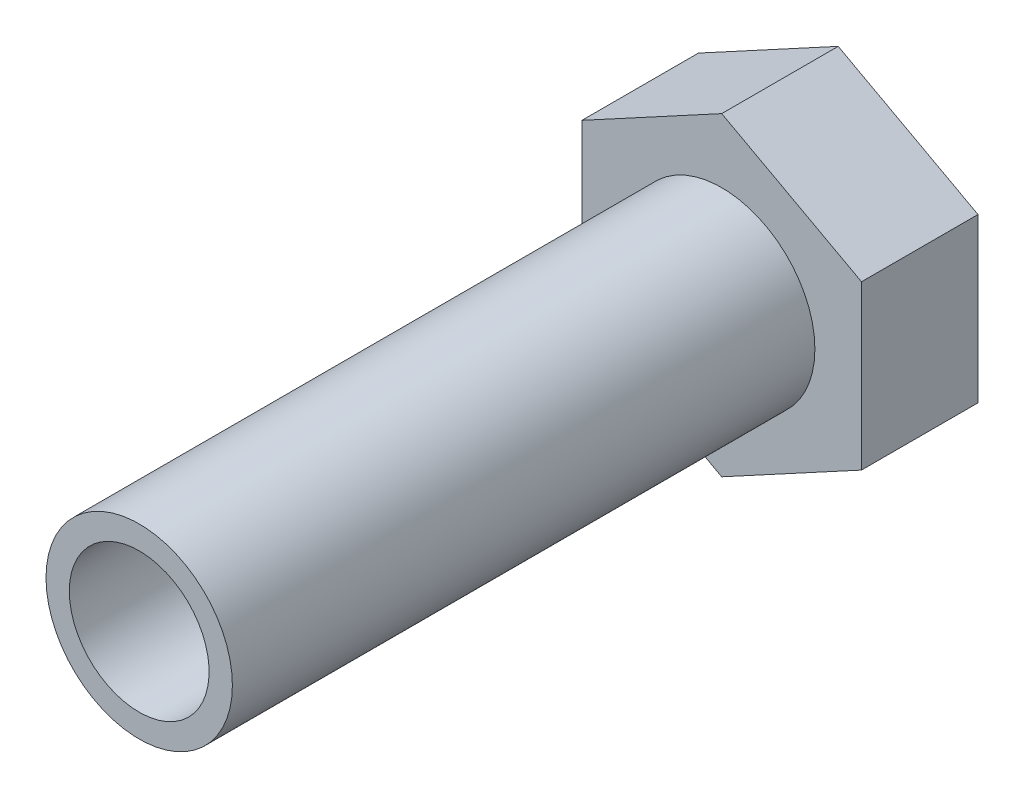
from build123d import *

# Parameters (mm, degrees)
EXTRUSION2_DEPTH        = 10
ESQUISSE2_R             = 8
EXTRUSION3_DEPTH        = 50
ESQUISSE3_R             = 6
ENL_V_MAT_EXTRU_1_DEPTH = 79.513262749


with BuildPart() as part:
    # Esquisse1 → Extrusion2 (new body)
    with BuildSketch(Plane.XY):
        Polygon((-45.968266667, 0.742666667), (-45.968266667, 14.742666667), (-33.968266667, 21.242666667), (-21.968266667, 14.742666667), (-21.968266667, 0.742666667), (-33.968266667, -5.757333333), align=None)
    extrude(amount=EXTRUSION2_DEPTH)

    # Esquisse2 → Extrusion3 (add)
    with BuildSketch(Plane.XY.offset(10)):
        with Locations(Location((-33.968266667, 7.742666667, 0), (0, 0, 180))):
            Circle(ESQUISSE2_R)
    extrude(amount=EXTRUSION3_DEPTH)

    # Esquisse3 → Enl_v. mat.-Extru.1 (cut, through all)
    with BuildSketch(Plane(origin=(0, 0, 0), x_dir=(-1, 0, 0), z_dir=(0, 0, -1))):
        with Locations((33.968266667, 7.742666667)):
            Circle(ESQUISSE3_R)
    extrude(amount=-ENL_V_MAT_EXTRU_1_DEPTH, mode=Mode.SUBTRACT)


solid = part.part
